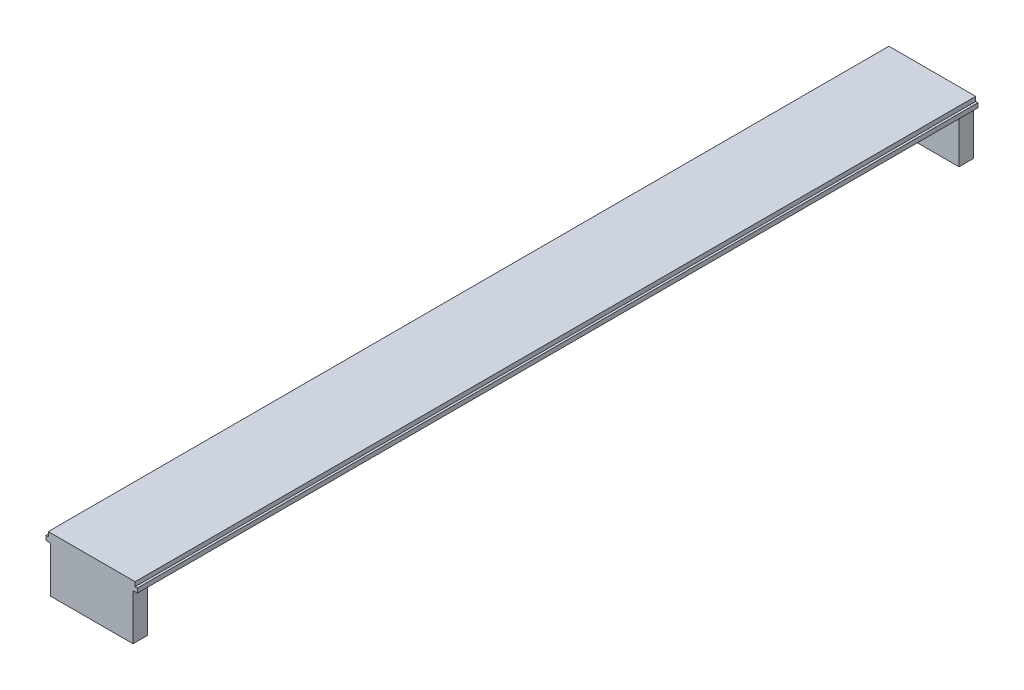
from build123d import *

# Parameters (mm, degrees)
BOSS_EXTRUDE1_DEPTH = 146.05
SKETCH2_W           = 14.351
SKETCH2_H           = 2.54
BOSS_EXTRUDE2_DEPTH = 8.001
SKETCH3_R           = 2.38125
CUT_EXTRUDE1_DEPTH  = 145.606886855


with BuildPart() as part:
    # Sketch1 → Boss-Extrude1 (new body)
    with BuildSketch(Plane.XY):
        Polygon((0, 0), (15.875, 0), (15.875, 0.762), (15.4813, 0.762), (15.4813, 1.524), (0.3937, 1.524), (0.3937, 0.762), (0, 0.762), align=None)
    extrude(amount=BOSS_EXTRUDE1_DEPTH)

    # Sketch2 → Boss-Extrude2 (add)
    with BuildSketch(Plane.XZ):
        with Locations((7.9375, 144.78)):
            Rectangle(SKETCH2_W, SKETCH2_H)
        with Locations((7.9375, 1.27)):
            Rectangle(SKETCH2_W, SKETCH2_H)
    extrude(amount=BOSS_EXTRUDE2_DEPTH)

    # Sketch3 → Cut-Extrude1 (cut, through all)
    with BuildSketch(Plane.XY.offset(2.54)):
        with Locations((7.9375, -3.2385)):
            Circle(SKETCH3_R)
    extrude(amount=-CUT_EXTRUDE1_DEPTH, mode=Mode.SUBTRACT)


solid = part.part
